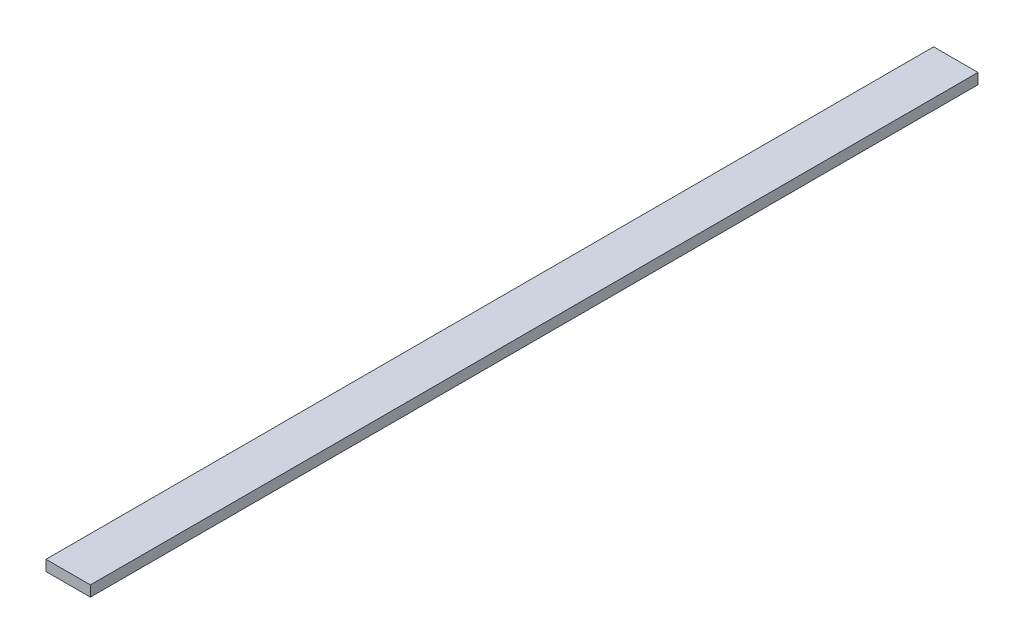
ISO-10303-21;
HEADER;
FILE_DESCRIPTION(('STEP AP214'),'2;1');
FILE_NAME('part.step','',(''),(''),'','','');
FILE_SCHEMA(('AUTOMOTIVE_DESIGN { 1 0 10303 214 1 1 1 1 }'));
ENDSEC;
DATA;
#1=APPLICATION_CONTEXT('core data for automotive mechanical design processes');
#2=APPLICATION_PROTOCOL_DEFINITION('international standard','automotive_design',2000,#1);
#3=PRODUCT_CONTEXT('',#1,'mechanical');
#4=PRODUCT('Part','Part','',(#3));
#5=PRODUCT_RELATED_PRODUCT_CATEGORY('part','',(#4));
#6=PRODUCT_DEFINITION_FORMATION('','',#4);
#7=PRODUCT_DEFINITION_CONTEXT('part definition',#1,'design');
#8=PRODUCT_DEFINITION('design','',#6,#7);
#9=PRODUCT_DEFINITION_SHAPE('','',#8);
#10=(LENGTH_UNIT() NAMED_UNIT(*) SI_UNIT(.MILLI.,.METRE.));
#11=(NAMED_UNIT(*) PLANE_ANGLE_UNIT() SI_UNIT($,.RADIAN.));
#12=(NAMED_UNIT(*) SI_UNIT($,.STERADIAN.) SOLID_ANGLE_UNIT());
#13=UNCERTAINTY_MEASURE_WITH_UNIT(LENGTH_MEASURE(1.E-05),#10,'distance_accuracy_value','');
#14=(GEOMETRIC_REPRESENTATION_CONTEXT(3) GLOBAL_UNCERTAINTY_ASSIGNED_CONTEXT((#13)) GLOBAL_UNIT_ASSIGNED_CONTEXT((#10,
#11,#12)) REPRESENTATION_CONTEXT('',''));
#15=CARTESIAN_POINT('',(0.,0.,0.));
#16=DIRECTION('',(0.,0.,1.));
#17=DIRECTION('',(1.,0.,0.));
#18=AXIS2_PLACEMENT_3D('',#15,#16,#17);
#19=CARTESIAN_POINT('',(-12.5,6.,1900.));
#20=DIRECTION('',(1.,0.,0.));
#21=DIRECTION('',(0.,0.,-1.));
#22=AXIS2_PLACEMENT_3D('',#19,#20,#21);
#23=PLANE('',#22);
#24=DIRECTION('',(0.,-1.,0.));
#25=VECTOR('',#24,1.);
#26=CARTESIAN_POINT('',(-12.5,6.,500.));
#27=LINE('',#26,#25);
#28=CARTESIAN_POINT('',(-12.5,6.,500.));
#29=VERTEX_POINT('',#28);
#30=CARTESIAN_POINT('',(-12.5,0.,500.));
#31=VERTEX_POINT('',#30);
#32=EDGE_CURVE('E54',#29,#31,#27,.T.);
#33=ORIENTED_EDGE('',*,*,#32,.F.);
#34=DIRECTION('',(0.,0.,-1.));
#35=VECTOR('',#34,1.);
#36=CARTESIAN_POINT('',(-12.5,6.,1900.));
#37=LINE('',#36,#35);
#38=CARTESIAN_POINT('',(-12.5,6.,0.));
#39=VERTEX_POINT('',#38);
#40=EDGE_CURVE('E36',#29,#39,#37,.T.);
#41=ORIENTED_EDGE('',*,*,#40,.T.);
#42=DIRECTION('',(0.,-1.,0.));
#43=VECTOR('',#42,1.);
#44=CARTESIAN_POINT('',(-12.5,6.,0.));
#45=LINE('',#44,#43);
#46=CARTESIAN_POINT('',(-12.5,0.,0.));
#47=VERTEX_POINT('',#46);
#48=EDGE_CURVE('E83',#39,#47,#45,.T.);
#49=ORIENTED_EDGE('',*,*,#48,.T.);
#50=DIRECTION('',(0.,0.,-1.));
#51=VECTOR('',#50,1.);
#52=CARTESIAN_POINT('',(-12.5,0.,1900.));
#53=LINE('',#52,#51);
#54=EDGE_CURVE('E9',#31,#47,#53,.T.);
#55=ORIENTED_EDGE('',*,*,#54,.F.);
#56=EDGE_LOOP('',(#33,#41,#49,#55));
#57=FACE_BOUND('',#56,.T.);
#58=ADVANCED_FACE('F14',(#57),#23,.F.);
#59=CARTESIAN_POINT('',(-12.5,0.,1900.));
#60=DIRECTION('',(0.,1.,0.));
#61=DIRECTION('',(-1.,0.,0.));
#62=AXIS2_PLACEMENT_3D('',#59,#60,#61);
#63=PLANE('',#62);
#64=DIRECTION('',(1.,0.,0.));
#65=VECTOR('',#64,1.);
#66=CARTESIAN_POINT('',(-12.5,0.,500.));
#67=LINE('',#66,#65);
#68=CARTESIAN_POINT('',(12.5,0.,500.));
#69=VERTEX_POINT('',#68);
#70=EDGE_CURVE('E60',#31,#69,#67,.T.);
#71=ORIENTED_EDGE('',*,*,#70,.F.);
#72=ORIENTED_EDGE('',*,*,#54,.T.);
#73=DIRECTION('',(1.,0.,0.));
#74=VECTOR('',#73,1.);
#75=CARTESIAN_POINT('',(-12.5,0.,0.));
#76=LINE('',#75,#74);
#77=CARTESIAN_POINT('',(12.5,0.,0.));
#78=VERTEX_POINT('',#77);
#79=EDGE_CURVE('E80',#47,#78,#76,.T.);
#80=ORIENTED_EDGE('',*,*,#79,.T.);
#81=DIRECTION('',(0.,0.,-1.));
#82=VECTOR('',#81,1.);
#83=CARTESIAN_POINT('',(12.5,0.,1900.));
#84=LINE('',#83,#82);
#85=EDGE_CURVE('E21',#69,#78,#84,.T.);
#86=ORIENTED_EDGE('',*,*,#85,.F.);
#87=EDGE_LOOP('',(#71,#72,#80,#86));
#88=FACE_BOUND('',#87,.T.);
#89=ADVANCED_FACE('F81',(#88),#63,.F.);
#90=CARTESIAN_POINT('',(12.5,6.,1900.));
#91=DIRECTION('',(-1.,0.,0.));
#92=DIRECTION('',(0.,0.,1.));
#93=AXIS2_PLACEMENT_3D('',#90,#91,#92);
#94=PLANE('',#93);
#95=DIRECTION('',(0.,1.,0.));
#96=VECTOR('',#95,1.);
#97=CARTESIAN_POINT('',(12.5,0.,500.));
#98=LINE('',#97,#96);
#99=CARTESIAN_POINT('',(12.5,6.,500.));
#100=VERTEX_POINT('',#99);
#101=EDGE_CURVE('E28',#69,#100,#98,.T.);
#102=ORIENTED_EDGE('',*,*,#101,.F.);
#103=ORIENTED_EDGE('',*,*,#85,.T.);
#104=DIRECTION('',(0.,1.,0.));
#105=VECTOR('',#104,1.);
#106=CARTESIAN_POINT('',(12.5,6.,0.));
#107=LINE('',#106,#105);
#108=CARTESIAN_POINT('',(12.5,6.,0.));
#109=VERTEX_POINT('',#108);
#110=EDGE_CURVE('E69',#78,#109,#107,.T.);
#111=ORIENTED_EDGE('',*,*,#110,.T.);
#112=DIRECTION('',(0.,0.,-1.));
#113=VECTOR('',#112,1.);
#114=CARTESIAN_POINT('',(12.5,6.,1900.));
#115=LINE('',#114,#113);
#116=EDGE_CURVE('E66',#100,#109,#115,.T.);
#117=ORIENTED_EDGE('',*,*,#116,.F.);
#118=EDGE_LOOP('',(#102,#103,#111,#117));
#119=FACE_BOUND('',#118,.T.);
#120=ADVANCED_FACE('F76',(#119),#94,.F.);
#121=CARTESIAN_POINT('',(-12.5,6.,1900.));
#122=DIRECTION('',(0.,-1.,0.));
#123=DIRECTION('',(0.,0.,-1.));
#124=AXIS2_PLACEMENT_3D('',#121,#122,#123);
#125=PLANE('',#124);
#126=DIRECTION('',(-1.,0.,0.));
#127=VECTOR('',#126,1.);
#128=CARTESIAN_POINT('',(12.5,6.,500.));
#129=LINE('',#128,#127);
#130=EDGE_CURVE('E52',#100,#29,#129,.T.);
#131=ORIENTED_EDGE('',*,*,#130,.F.);
#132=ORIENTED_EDGE('',*,*,#116,.T.);
#133=DIRECTION('',(-1.,0.,0.));
#134=VECTOR('',#133,1.);
#135=CARTESIAN_POINT('',(-12.5,6.,0.));
#136=LINE('',#135,#134);
#137=EDGE_CURVE('E64',#109,#39,#136,.T.);
#138=ORIENTED_EDGE('',*,*,#137,.T.);
#139=ORIENTED_EDGE('',*,*,#40,.F.);
#140=EDGE_LOOP('',(#131,#132,#138,#139));
#141=FACE_BOUND('',#140,.T.);
#142=ADVANCED_FACE('F62',(#141),#125,.F.);
#143=CARTESIAN_POINT('',(-12.5,6.,0.));
#144=DIRECTION('',(0.,0.,1.));
#145=DIRECTION('',(1.,0.,0.));
#146=AXIS2_PLACEMENT_3D('',#143,#144,#145);
#147=PLANE('',#146);
#148=ORIENTED_EDGE('',*,*,#48,.F.);
#149=ORIENTED_EDGE('',*,*,#137,.F.);
#150=ORIENTED_EDGE('',*,*,#110,.F.);
#151=ORIENTED_EDGE('',*,*,#79,.F.);
#152=EDGE_LOOP('',(#148,#149,#150,#151));
#153=FACE_BOUND('',#152,.T.);
#154=ADVANCED_FACE('F85',(#153),#147,.F.);
#155=CARTESIAN_POINT('',(-12.5,6.,500.));
#156=DIRECTION('',(0.,0.,1.));
#157=DIRECTION('',(1.,0.,0.));
#158=AXIS2_PLACEMENT_3D('',#155,#156,#157);
#159=PLANE('',#158);
#160=ORIENTED_EDGE('',*,*,#130,.T.);
#161=ORIENTED_EDGE('',*,*,#32,.T.);
#162=ORIENTED_EDGE('',*,*,#70,.T.);
#163=ORIENTED_EDGE('',*,*,#101,.T.);
#164=EDGE_LOOP('',(#160,#161,#162,#163));
#165=FACE_BOUND('',#164,.T.);
#166=ADVANCED_FACE('F53',(#165),#159,.T.);
#167=CLOSED_SHELL('',(#58,#89,#120,#142,#154,#166));
#168=MANIFOLD_SOLID_BREP('B1',#167);
#169=ADVANCED_BREP_SHAPE_REPRESENTATION('',(#18,#168),#14);
#170=SHAPE_DEFINITION_REPRESENTATION(#9,#169);
ENDSEC;
END-ISO-10303-21;
